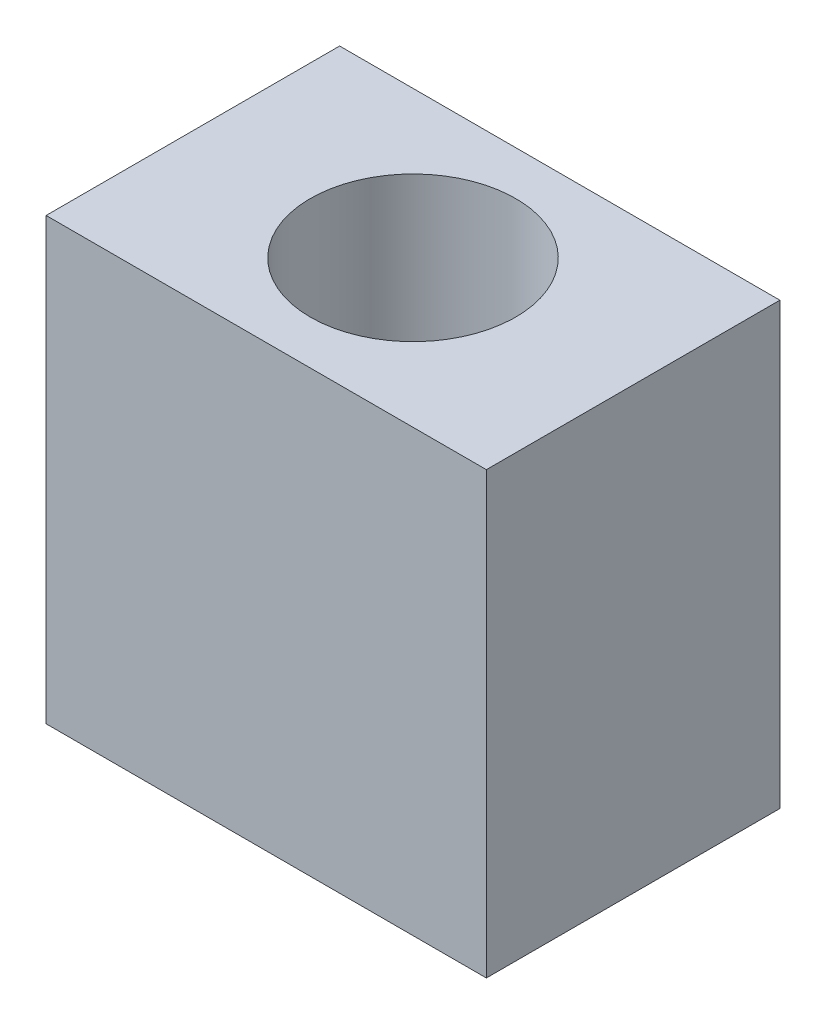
ISO-10303-21;
HEADER;
FILE_DESCRIPTION(('STEP AP214'),'2;1');
FILE_NAME('part.step','',(''),(''),'','','');
FILE_SCHEMA(('AUTOMOTIVE_DESIGN { 1 0 10303 214 1 1 1 1 }'));
ENDSEC;
DATA;
#1=APPLICATION_CONTEXT('core data for automotive mechanical design processes');
#2=APPLICATION_PROTOCOL_DEFINITION('international standard','automotive_design',2000,#1);
#3=PRODUCT_CONTEXT('',#1,'mechanical');
#4=PRODUCT('Part','Part','',(#3));
#5=PRODUCT_RELATED_PRODUCT_CATEGORY('part','',(#4));
#6=PRODUCT_DEFINITION_FORMATION('','',#4);
#7=PRODUCT_DEFINITION_CONTEXT('part definition',#1,'design');
#8=PRODUCT_DEFINITION('design','',#6,#7);
#9=PRODUCT_DEFINITION_SHAPE('','',#8);
#10=(LENGTH_UNIT() NAMED_UNIT(*) SI_UNIT(.MILLI.,.METRE.));
#11=(NAMED_UNIT(*) PLANE_ANGLE_UNIT() SI_UNIT($,.RADIAN.));
#12=(NAMED_UNIT(*) SI_UNIT($,.STERADIAN.) SOLID_ANGLE_UNIT());
#13=UNCERTAINTY_MEASURE_WITH_UNIT(LENGTH_MEASURE(1.E-05),#10,'distance_accuracy_value','');
#14=(GEOMETRIC_REPRESENTATION_CONTEXT(3) GLOBAL_UNCERTAINTY_ASSIGNED_CONTEXT((#13)) GLOBAL_UNIT_ASSIGNED_CONTEXT((#10,
#11,#12)) REPRESENTATION_CONTEXT('',''));
#15=CARTESIAN_POINT('',(0.,0.,0.));
#16=DIRECTION('',(0.,0.,1.));
#17=DIRECTION('',(1.,0.,0.));
#18=AXIS2_PLACEMENT_3D('',#15,#16,#17);
#19=CARTESIAN_POINT('',(0.,0.,20.));
#20=DIRECTION('',(1.,0.,0.));
#21=DIRECTION('',(0.,1.,0.));
#22=AXIS2_PLACEMENT_3D('',#19,#20,#21);
#23=PLANE('',#22);
#24=DIRECTION('',(0.,-1.,0.));
#25=VECTOR('',#24,1.);
#26=CARTESIAN_POINT('',(0.,0.,0.));
#27=LINE('',#26,#25);
#28=CARTESIAN_POINT('',(0.,0.,0.));
#29=VERTEX_POINT('',#28);
#30=CARTESIAN_POINT('',(0.,-30.,0.));
#31=VERTEX_POINT('',#30);
#32=EDGE_CURVE('E99',#29,#31,#27,.T.);
#33=ORIENTED_EDGE('',*,*,#32,.T.);
#34=DIRECTION('',(0.,0.,-1.));
#35=VECTOR('',#34,1.);
#36=CARTESIAN_POINT('',(0.,-30.,20.));
#37=LINE('',#36,#35);
#38=CARTESIAN_POINT('',(0.,-30.,20.));
#39=VERTEX_POINT('',#38);
#40=EDGE_CURVE('E11',#39,#31,#37,.T.);
#41=ORIENTED_EDGE('',*,*,#40,.F.);
#42=DIRECTION('',(0.,-1.,0.));
#43=VECTOR('',#42,1.);
#44=CARTESIAN_POINT('',(0.,0.,20.));
#45=LINE('',#44,#43);
#46=CARTESIAN_POINT('',(0.,0.,20.));
#47=VERTEX_POINT('',#46);
#48=EDGE_CURVE('E84',#47,#39,#45,.T.);
#49=ORIENTED_EDGE('',*,*,#48,.F.);
#50=DIRECTION('',(0.,0.,-1.));
#51=VECTOR('',#50,1.);
#52=CARTESIAN_POINT('',(0.,0.,20.));
#53=LINE('',#52,#51);
#54=EDGE_CURVE('E95',#47,#29,#53,.T.);
#55=ORIENTED_EDGE('',*,*,#54,.T.);
#56=EDGE_LOOP('',(#33,#41,#49,#55));
#57=FACE_BOUND('',#56,.T.);
#58=ADVANCED_FACE('F33',(#57),#23,.F.);
#59=CARTESIAN_POINT('',(0.,-30.,20.));
#60=DIRECTION('',(0.,1.,0.));
#61=DIRECTION('',(0.,0.,1.));
#62=AXIS2_PLACEMENT_3D('',#59,#60,#61);
#63=PLANE('',#62);
#64=CARTESIAN_POINT('',(15.,-30.,10.));
#65=DIRECTION('',(0.,1.,0.));
#66=DIRECTION('',(0.,0.,1.));
#67=AXIS2_PLACEMENT_3D('',#64,#65,#66);
#68=CIRCLE('',#67,7.);
#69=CARTESIAN_POINT('',(15.,-30.,17.));
#70=VERTEX_POINT('',#69);
#71=EDGE_CURVE('E102',#70,#70,#68,.T.);
#72=ORIENTED_EDGE('',*,*,#71,.T.);
#73=EDGE_LOOP('',(#72));
#74=FACE_BOUND('',#73,.T.);
#75=DIRECTION('',(1.,0.,0.));
#76=VECTOR('',#75,1.);
#77=CARTESIAN_POINT('',(0.,-30.,0.));
#78=LINE('',#77,#76);
#79=CARTESIAN_POINT('',(30.,-30.,0.));
#80=VERTEX_POINT('',#79);
#81=EDGE_CURVE('E88',#31,#80,#78,.T.);
#82=ORIENTED_EDGE('',*,*,#81,.T.);
#83=DIRECTION('',(0.,0.,-1.));
#84=VECTOR('',#83,1.);
#85=CARTESIAN_POINT('',(30.,-30.,20.));
#86=LINE('',#85,#84);
#87=CARTESIAN_POINT('',(30.,-30.,20.));
#88=VERTEX_POINT('',#87);
#89=EDGE_CURVE('E41',#88,#80,#86,.T.);
#90=ORIENTED_EDGE('',*,*,#89,.F.);
#91=DIRECTION('',(1.,0.,0.));
#92=VECTOR('',#91,1.);
#93=CARTESIAN_POINT('',(0.,-30.,20.));
#94=LINE('',#93,#92);
#95=EDGE_CURVE('E79',#39,#88,#94,.T.);
#96=ORIENTED_EDGE('',*,*,#95,.F.);
#97=ORIENTED_EDGE('',*,*,#40,.T.);
#98=EDGE_LOOP('',(#82,#90,#96,#97));
#99=FACE_BOUND('',#98,.T.);
#100=ADVANCED_FACE('F87',(#74,#99),#63,.F.);
#101=CARTESIAN_POINT('',(30.,0.,20.));
#102=DIRECTION('',(-1.,0.,0.));
#103=DIRECTION('',(0.,-1.,0.));
#104=AXIS2_PLACEMENT_3D('',#101,#102,#103);
#105=PLANE('',#104);
#106=DIRECTION('',(0.,1.,0.));
#107=VECTOR('',#106,1.);
#108=CARTESIAN_POINT('',(30.,0.,0.));
#109=LINE('',#108,#107);
#110=CARTESIAN_POINT('',(30.,0.,0.));
#111=VERTEX_POINT('',#110);
#112=EDGE_CURVE('E66',#80,#111,#109,.T.);
#113=ORIENTED_EDGE('',*,*,#112,.T.);
#114=DIRECTION('',(0.,0.,-1.));
#115=VECTOR('',#114,1.);
#116=CARTESIAN_POINT('',(30.,0.,20.));
#117=LINE('',#116,#115);
#118=CARTESIAN_POINT('',(30.,0.,20.));
#119=VERTEX_POINT('',#118);
#120=EDGE_CURVE('E89',#119,#111,#117,.T.);
#121=ORIENTED_EDGE('',*,*,#120,.F.);
#122=DIRECTION('',(0.,1.,0.));
#123=VECTOR('',#122,1.);
#124=CARTESIAN_POINT('',(30.,0.,20.));
#125=LINE('',#124,#123);
#126=EDGE_CURVE('E82',#88,#119,#125,.T.);
#127=ORIENTED_EDGE('',*,*,#126,.F.);
#128=ORIENTED_EDGE('',*,*,#89,.T.);
#129=EDGE_LOOP('',(#113,#121,#127,#128));
#130=FACE_BOUND('',#129,.T.);
#131=ADVANCED_FACE('F90',(#130),#105,.F.);
#132=CARTESIAN_POINT('',(0.,0.,20.));
#133=DIRECTION('',(0.,-1.,0.));
#134=DIRECTION('',(0.,0.,-1.));
#135=AXIS2_PLACEMENT_3D('',#132,#133,#134);
#136=PLANE('',#135);
#137=CARTESIAN_POINT('',(15.,0.,10.));
#138=DIRECTION('',(0.,1.,0.));
#139=DIRECTION('',(0.,0.,1.));
#140=AXIS2_PLACEMENT_3D('',#137,#138,#139);
#141=CIRCLE('',#140,7.);
#142=CARTESIAN_POINT('',(15.,0.,17.));
#143=VERTEX_POINT('',#142);
#144=EDGE_CURVE('E115',#143,#143,#141,.T.);
#145=ORIENTED_EDGE('',*,*,#144,.F.);
#146=EDGE_LOOP('',(#145));
#147=FACE_BOUND('',#146,.T.);
#148=DIRECTION('',(-1.,0.,0.));
#149=VECTOR('',#148,1.);
#150=CARTESIAN_POINT('',(0.,0.,0.));
#151=LINE('',#150,#149);
#152=EDGE_CURVE('E72',#111,#29,#151,.T.);
#153=ORIENTED_EDGE('',*,*,#152,.T.);
#154=ORIENTED_EDGE('',*,*,#54,.F.);
#155=DIRECTION('',(-1.,0.,0.));
#156=VECTOR('',#155,1.);
#157=CARTESIAN_POINT('',(0.,0.,20.));
#158=LINE('',#157,#156);
#159=EDGE_CURVE('E49',#119,#47,#158,.T.);
#160=ORIENTED_EDGE('',*,*,#159,.F.);
#161=ORIENTED_EDGE('',*,*,#120,.T.);
#162=EDGE_LOOP('',(#153,#154,#160,#161));
#163=FACE_BOUND('',#162,.T.);
#164=ADVANCED_FACE('F107',(#147,#163),#136,.F.);
#165=CARTESIAN_POINT('',(0.,-30.,20.));
#166=DIRECTION('',(0.,0.,1.));
#167=DIRECTION('',(1.,0.,0.));
#168=AXIS2_PLACEMENT_3D('',#165,#166,#167);
#169=PLANE('',#168);
#170=ORIENTED_EDGE('',*,*,#48,.T.);
#171=ORIENTED_EDGE('',*,*,#95,.T.);
#172=ORIENTED_EDGE('',*,*,#126,.T.);
#173=ORIENTED_EDGE('',*,*,#159,.T.);
#174=EDGE_LOOP('',(#170,#171,#172,#173));
#175=FACE_BOUND('',#174,.T.);
#176=ADVANCED_FACE('F80',(#175),#169,.T.);
#177=CARTESIAN_POINT('',(0.,-30.,0.));
#178=DIRECTION('',(0.,0.,1.));
#179=DIRECTION('',(1.,0.,0.));
#180=AXIS2_PLACEMENT_3D('',#177,#178,#179);
#181=PLANE('',#180);
#182=ORIENTED_EDGE('',*,*,#32,.F.);
#183=ORIENTED_EDGE('',*,*,#152,.F.);
#184=ORIENTED_EDGE('',*,*,#112,.F.);
#185=ORIENTED_EDGE('',*,*,#81,.F.);
#186=EDGE_LOOP('',(#182,#183,#184,#185));
#187=FACE_BOUND('',#186,.T.);
#188=ADVANCED_FACE('F110',(#187),#181,.F.);
#189=CARTESIAN_POINT('',(15.,0.,10.));
#190=DIRECTION('',(0.,1.,0.));
#191=DIRECTION('',(0.,0.,1.));
#192=AXIS2_PLACEMENT_3D('',#189,#190,#191);
#193=CYLINDRICAL_SURFACE('',#192,7.);
#194=ORIENTED_EDGE('',*,*,#144,.T.);
#195=EDGE_LOOP('',(#194));
#196=FACE_BOUND('',#195,.T.);
#197=ORIENTED_EDGE('',*,*,#71,.F.);
#198=EDGE_LOOP('',(#197));
#199=FACE_BOUND('',#198,.T.);
#200=ADVANCED_FACE('F119',(#196,#199),#193,.F.);
#201=CLOSED_SHELL('',(#58,#100,#131,#164,#176,#188,#200));
#202=MANIFOLD_SOLID_BREP('B2',#201);
#203=ADVANCED_BREP_SHAPE_REPRESENTATION('',(#18,#202),#14);
#204=SHAPE_DEFINITION_REPRESENTATION(#9,#203);
ENDSEC;
END-ISO-10303-21;
